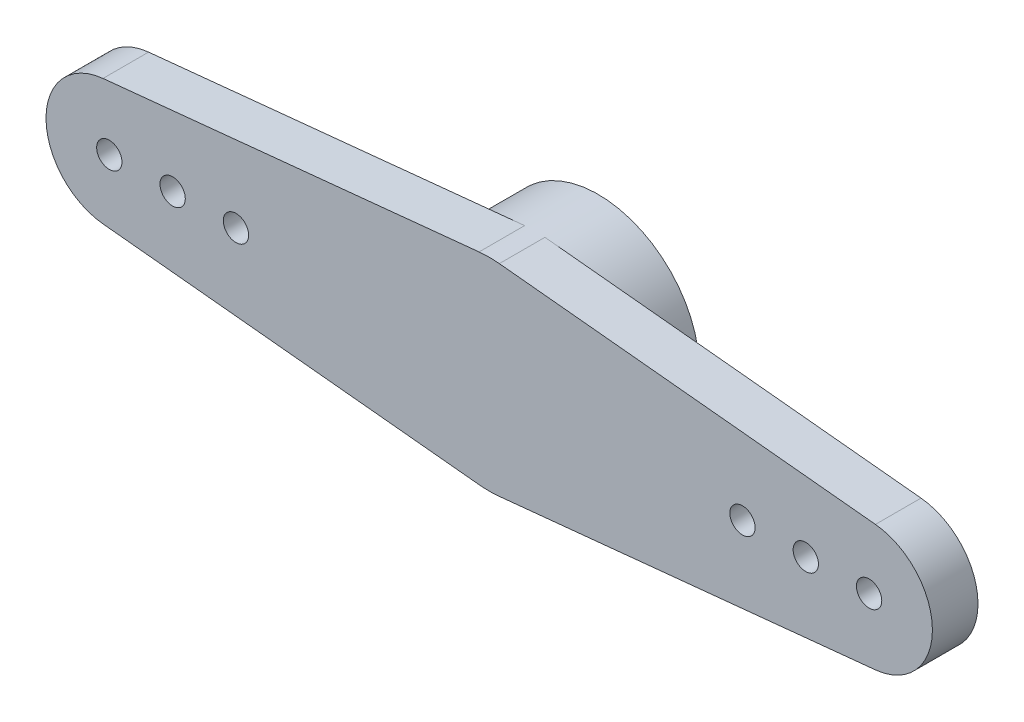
ISO-10303-21;
HEADER;
FILE_DESCRIPTION(('STEP AP214'),'2;1');
FILE_NAME('part.step','',(''),(''),'','','');
FILE_SCHEMA(('AUTOMOTIVE_DESIGN { 1 0 10303 214 1 1 1 1 }'));
ENDSEC;
DATA;
#1=APPLICATION_CONTEXT('core data for automotive mechanical design processes');
#2=APPLICATION_PROTOCOL_DEFINITION('international standard','automotive_design',2000,#1);
#3=PRODUCT_CONTEXT('',#1,'mechanical');
#4=PRODUCT('Part','Part','',(#3));
#5=PRODUCT_RELATED_PRODUCT_CATEGORY('part','',(#4));
#6=PRODUCT_DEFINITION_FORMATION('','',#4);
#7=PRODUCT_DEFINITION_CONTEXT('part definition',#1,'design');
#8=PRODUCT_DEFINITION('design','',#6,#7);
#9=PRODUCT_DEFINITION_SHAPE('','',#8);
#10=(LENGTH_UNIT() NAMED_UNIT(*) SI_UNIT(.MILLI.,.METRE.));
#11=(NAMED_UNIT(*) PLANE_ANGLE_UNIT() SI_UNIT($,.RADIAN.));
#12=(NAMED_UNIT(*) SI_UNIT($,.STERADIAN.) SOLID_ANGLE_UNIT());
#13=UNCERTAINTY_MEASURE_WITH_UNIT(LENGTH_MEASURE(1.E-05),#10,'distance_accuracy_value','');
#14=(GEOMETRIC_REPRESENTATION_CONTEXT(3) GLOBAL_UNCERTAINTY_ASSIGNED_CONTEXT((#13)) GLOBAL_UNIT_ASSIGNED_CONTEXT((#10,
#11,#12)) REPRESENTATION_CONTEXT('',''));
#15=CARTESIAN_POINT('',(0.,0.,0.));
#16=DIRECTION('',(0.,0.,1.));
#17=DIRECTION('',(1.,0.,0.));
#18=AXIS2_PLACEMENT_3D('',#15,#16,#17);
#19=CARTESIAN_POINT('',(0.,0.,0.));
#20=DIRECTION('',(0.,0.,1.));
#21=DIRECTION('',(1.,0.,0.));
#22=AXIS2_PLACEMENT_3D('',#19,#20,#21);
#23=PLANE('',#22);
#24=CARTESIAN_POINT('',(-12.5,0.,0.));
#25=DIRECTION('',(0.,0.,1.));
#26=DIRECTION('',(1.,0.,0.));
#27=AXIS2_PLACEMENT_3D('',#24,#25,#26);
#28=CIRCLE('',#27,0.500000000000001);
#29=CARTESIAN_POINT('',(-12.,0.,0.));
#30=VERTEX_POINT('',#29);
#31=EDGE_CURVE('E181',#30,#30,#28,.T.);
#32=ORIENTED_EDGE('',*,*,#31,.T.);
#33=EDGE_LOOP('',(#32));
#34=FACE_BOUND('',#33,.T.);
#35=CARTESIAN_POINT('',(-15.,0.,0.));
#36=DIRECTION('',(0.,0.,1.));
#37=DIRECTION('',(1.,0.,0.));
#38=AXIS2_PLACEMENT_3D('',#35,#36,#37);
#39=CIRCLE('',#38,0.500000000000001);
#40=CARTESIAN_POINT('',(-14.5,0.,0.));
#41=VERTEX_POINT('',#40);
#42=EDGE_CURVE('E175',#41,#41,#39,.T.);
#43=ORIENTED_EDGE('',*,*,#42,.T.);
#44=EDGE_LOOP('',(#43));
#45=FACE_BOUND('',#44,.T.);
#46=CARTESIAN_POINT('',(-10.,0.,0.));
#47=DIRECTION('',(0.,0.,1.));
#48=DIRECTION('',(1.,0.,0.));
#49=AXIS2_PLACEMENT_3D('',#46,#47,#48);
#50=CIRCLE('',#49,0.500000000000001);
#51=CARTESIAN_POINT('',(-9.5,0.,0.));
#52=VERTEX_POINT('',#51);
#53=EDGE_CURVE('E187',#52,#52,#50,.T.);
#54=ORIENTED_EDGE('',*,*,#53,.T.);
#55=EDGE_LOOP('',(#54));
#56=FACE_BOUND('',#55,.T.);
#57=DIRECTION('',(-0.99498743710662,-0.1,0.));
#58=VECTOR('',#57,1.);
#59=CARTESIAN_POINT('',(-15.25,2.48746859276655,0.));
#60=LINE('',#59,#58);
#61=CARTESIAN_POINT('',(-0.4,3.97994974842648,0.));
#62=VERTEX_POINT('',#61);
#63=CARTESIAN_POINT('',(-15.25,2.48746859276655,0.));
#64=VERTEX_POINT('',#63);
#65=EDGE_CURVE('E72',#62,#64,#60,.T.);
#66=ORIENTED_EDGE('',*,*,#65,.F.);
#67=CARTESIAN_POINT('',(0.,0.,0.));
#68=DIRECTION('',(0.,0.,1.));
#69=DIRECTION('',(1.,0.,0.));
#70=AXIS2_PLACEMENT_3D('',#67,#68,#69);
#71=CIRCLE('',#70,4.);
#72=CARTESIAN_POINT('',(-0.4,-3.97994974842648,0.));
#73=VERTEX_POINT('',#72);
#74=EDGE_CURVE('E211',#62,#73,#71,.T.);
#75=ORIENTED_EDGE('',*,*,#74,.T.);
#76=DIRECTION('',(0.99498743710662,-0.1,0.));
#77=VECTOR('',#76,1.);
#78=CARTESIAN_POINT('',(-15.25,-2.48746859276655,0.));
#79=LINE('',#78,#77);
#80=CARTESIAN_POINT('',(-15.25,-2.48746859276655,0.));
#81=VERTEX_POINT('',#80);
#82=EDGE_CURVE('E132',#81,#73,#79,.T.);
#83=ORIENTED_EDGE('',*,*,#82,.F.);
#84=CARTESIAN_POINT('',(-15.,0.,0.));
#85=DIRECTION('',(0.,0.,1.));
#86=DIRECTION('',(1.,0.,0.));
#87=AXIS2_PLACEMENT_3D('',#84,#85,#86);
#88=CIRCLE('',#87,2.5);
#89=EDGE_CURVE('E79',#64,#81,#88,.T.);
#90=ORIENTED_EDGE('',*,*,#89,.F.);
#91=EDGE_LOOP('',(#66,#75,#83,#90));
#92=FACE_BOUND('',#91,.T.);
#93=ADVANCED_FACE('F34',(#34,#45,#56,#92),#23,.F.);
#94=CARTESIAN_POINT('',(0.,0.,1.8));
#95=DIRECTION('',(0.,0.,1.));
#96=DIRECTION('',(1.,0.,0.));
#97=AXIS2_PLACEMENT_3D('',#94,#95,#96);
#98=PLANE('',#97);
#99=DIRECTION('',(-0.99498743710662,0.1,0.));
#100=VECTOR('',#99,1.);
#101=CARTESIAN_POINT('',(0.4,3.97994974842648,1.8));
#102=LINE('',#101,#100);
#103=CARTESIAN_POINT('',(15.25,2.48746859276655,1.8));
#104=VERTEX_POINT('',#103);
#105=CARTESIAN_POINT('',(0.4,3.97994974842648,1.8));
#106=VERTEX_POINT('',#105);
#107=EDGE_CURVE('E169',#104,#106,#102,.T.);
#108=ORIENTED_EDGE('',*,*,#107,.T.);
#109=CARTESIAN_POINT('',(0.,0.,1.8));
#110=DIRECTION('',(0.,0.,1.));
#111=DIRECTION('',(1.,0.,0.));
#112=AXIS2_PLACEMENT_3D('',#109,#110,#111);
#113=CIRCLE('',#112,4.);
#114=CARTESIAN_POINT('',(-0.4,3.97994974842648,1.8));
#115=VERTEX_POINT('',#114);
#116=EDGE_CURVE('E108',#106,#115,#113,.T.);
#117=ORIENTED_EDGE('',*,*,#116,.T.);
#118=DIRECTION('',(-0.99498743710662,-0.1,0.));
#119=VECTOR('',#118,1.);
#120=CARTESIAN_POINT('',(-15.25,2.48746859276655,1.8));
#121=LINE('',#120,#119);
#122=CARTESIAN_POINT('',(-15.25,2.48746859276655,1.8));
#123=VERTEX_POINT('',#122);
#124=EDGE_CURVE('E102',#115,#123,#121,.T.);
#125=ORIENTED_EDGE('',*,*,#124,.T.);
#126=CARTESIAN_POINT('',(-15.,0.,1.8));
#127=DIRECTION('',(0.,0.,1.));
#128=DIRECTION('',(1.,0.,0.));
#129=AXIS2_PLACEMENT_3D('',#126,#127,#128);
#130=CIRCLE('',#129,2.5);
#131=CARTESIAN_POINT('',(-15.25,-2.48746859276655,1.8));
#132=VERTEX_POINT('',#131);
#133=EDGE_CURVE('E106',#123,#132,#130,.T.);
#134=ORIENTED_EDGE('',*,*,#133,.T.);
#135=DIRECTION('',(0.99498743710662,-0.1,0.));
#136=VECTOR('',#135,1.);
#137=CARTESIAN_POINT('',(-15.25,-2.48746859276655,1.8));
#138=LINE('',#137,#136);
#139=CARTESIAN_POINT('',(-0.4,-3.97994974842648,1.8));
#140=VERTEX_POINT('',#139);
#141=EDGE_CURVE('E51',#132,#140,#138,.T.);
#142=ORIENTED_EDGE('',*,*,#141,.T.);
#143=CARTESIAN_POINT('',(0.,0.,1.8));
#144=DIRECTION('',(0.,0.,1.));
#145=DIRECTION('',(1.,0.,0.));
#146=AXIS2_PLACEMENT_3D('',#143,#144,#145);
#147=CIRCLE('',#146,4.);
#148=CARTESIAN_POINT('',(0.4,-3.97994974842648,1.8));
#149=VERTEX_POINT('',#148);
#150=EDGE_CURVE('E135',#140,#149,#147,.T.);
#151=ORIENTED_EDGE('',*,*,#150,.T.);
#152=DIRECTION('',(0.99498743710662,0.1,0.));
#153=VECTOR('',#152,1.);
#154=CARTESIAN_POINT('',(15.25,-2.48746859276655,1.8));
#155=LINE('',#154,#153);
#156=CARTESIAN_POINT('',(15.25,-2.48746859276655,1.8));
#157=VERTEX_POINT('',#156);
#158=EDGE_CURVE('E87',#149,#157,#155,.T.);
#159=ORIENTED_EDGE('',*,*,#158,.T.);
#160=CARTESIAN_POINT('',(15.,0.,1.8));
#161=DIRECTION('',(0.,0.,1.));
#162=DIRECTION('',(1.,0.,0.));
#163=AXIS2_PLACEMENT_3D('',#160,#161,#162);
#164=CIRCLE('',#163,2.5);
#165=EDGE_CURVE('E151',#157,#104,#164,.T.);
#166=ORIENTED_EDGE('',*,*,#165,.T.);
#167=EDGE_LOOP('',(#108,#117,#125,#134,#142,#151,#159,#166));
#168=FACE_BOUND('',#167,.T.);
#169=CARTESIAN_POINT('',(12.5,0.,1.8));
#170=DIRECTION('',(0.,0.,1.));
#171=DIRECTION('',(1.,0.,0.));
#172=AXIS2_PLACEMENT_3D('',#169,#170,#171);
#173=CIRCLE('',#172,0.500000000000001);
#174=CARTESIAN_POINT('',(13.,0.,1.8));
#175=VERTEX_POINT('',#174);
#176=EDGE_CURVE('E196',#175,#175,#173,.T.);
#177=ORIENTED_EDGE('',*,*,#176,.F.);
#178=EDGE_LOOP('',(#177));
#179=FACE_BOUND('',#178,.T.);
#180=CARTESIAN_POINT('',(10.,0.,1.8));
#181=DIRECTION('',(0.,0.,1.));
#182=DIRECTION('',(1.,0.,0.));
#183=AXIS2_PLACEMENT_3D('',#180,#181,#182);
#184=CIRCLE('',#183,0.500000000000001);
#185=CARTESIAN_POINT('',(10.5,0.,1.8));
#186=VERTEX_POINT('',#185);
#187=EDGE_CURVE('E190',#186,#186,#184,.T.);
#188=ORIENTED_EDGE('',*,*,#187,.F.);
#189=EDGE_LOOP('',(#188));
#190=FACE_BOUND('',#189,.T.);
#191=CARTESIAN_POINT('',(15.,0.,1.8));
#192=DIRECTION('',(0.,0.,1.));
#193=DIRECTION('',(1.,0.,0.));
#194=AXIS2_PLACEMENT_3D('',#191,#192,#193);
#195=CIRCLE('',#194,0.500000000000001);
#196=CARTESIAN_POINT('',(15.5,0.,1.8));
#197=VERTEX_POINT('',#196);
#198=EDGE_CURVE('E202',#197,#197,#195,.T.);
#199=ORIENTED_EDGE('',*,*,#198,.F.);
#200=EDGE_LOOP('',(#199));
#201=FACE_BOUND('',#200,.T.);
#202=CARTESIAN_POINT('',(-12.5,0.,1.8));
#203=DIRECTION('',(0.,0.,1.));
#204=DIRECTION('',(1.,0.,0.));
#205=AXIS2_PLACEMENT_3D('',#202,#203,#204);
#206=CIRCLE('',#205,0.500000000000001);
#207=CARTESIAN_POINT('',(-12.,0.,1.8));
#208=VERTEX_POINT('',#207);
#209=EDGE_CURVE('E178',#208,#208,#206,.T.);
#210=ORIENTED_EDGE('',*,*,#209,.F.);
#211=EDGE_LOOP('',(#210));
#212=FACE_BOUND('',#211,.T.);
#213=CARTESIAN_POINT('',(-15.,0.,1.8));
#214=DIRECTION('',(0.,0.,1.));
#215=DIRECTION('',(1.,0.,0.));
#216=AXIS2_PLACEMENT_3D('',#213,#214,#215);
#217=CIRCLE('',#216,0.500000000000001);
#218=CARTESIAN_POINT('',(-14.5,0.,1.8));
#219=VERTEX_POINT('',#218);
#220=EDGE_CURVE('E125',#219,#219,#217,.T.);
#221=ORIENTED_EDGE('',*,*,#220,.F.);
#222=EDGE_LOOP('',(#221));
#223=FACE_BOUND('',#222,.T.);
#224=CARTESIAN_POINT('',(-10.,0.,1.8));
#225=DIRECTION('',(0.,0.,1.));
#226=DIRECTION('',(1.,0.,0.));
#227=AXIS2_PLACEMENT_3D('',#224,#225,#226);
#228=CIRCLE('',#227,0.500000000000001);
#229=CARTESIAN_POINT('',(-9.5,0.,1.8));
#230=VERTEX_POINT('',#229);
#231=EDGE_CURVE('E184',#230,#230,#228,.T.);
#232=ORIENTED_EDGE('',*,*,#231,.F.);
#233=EDGE_LOOP('',(#232));
#234=FACE_BOUND('',#233,.T.);
#235=ADVANCED_FACE('F103',(#168,#179,#190,#201,#212,#223,#234),#98,.T.);
#236=CARTESIAN_POINT('',(12.5,0.,0.));
#237=DIRECTION('',(0.,0.,1.));
#238=DIRECTION('',(1.,0.,0.));
#239=AXIS2_PLACEMENT_3D('',#236,#237,#238);
#240=CIRCLE('',#239,0.500000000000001);
#241=CARTESIAN_POINT('',(13.,0.,0.));
#242=VERTEX_POINT('',#241);
#243=EDGE_CURVE('E199',#242,#242,#240,.T.);
#244=ORIENTED_EDGE('',*,*,#243,.T.);
#245=EDGE_LOOP('',(#244));
#246=FACE_BOUND('',#245,.T.);
#247=DIRECTION('',(0.99498743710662,0.1,0.));
#248=VECTOR('',#247,1.);
#249=CARTESIAN_POINT('',(15.25,-2.48746859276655,0.));
#250=LINE('',#249,#248);
#251=CARTESIAN_POINT('',(0.4,-3.97994974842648,0.));
#252=VERTEX_POINT('',#251);
#253=CARTESIAN_POINT('',(15.25,-2.48746859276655,0.));
#254=VERTEX_POINT('',#253);
#255=EDGE_CURVE('E122',#252,#254,#250,.T.);
#256=ORIENTED_EDGE('',*,*,#255,.F.);
#257=CARTESIAN_POINT('',(0.4,3.97994974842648,0.));
#258=VERTEX_POINT('',#257);
#259=EDGE_CURVE('E159',#252,#258,#71,.T.);
#260=ORIENTED_EDGE('',*,*,#259,.T.);
#261=DIRECTION('',(-0.99498743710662,0.1,0.));
#262=VECTOR('',#261,1.);
#263=CARTESIAN_POINT('',(0.4,3.97994974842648,0.));
#264=LINE('',#263,#262);
#265=CARTESIAN_POINT('',(15.25,2.48746859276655,0.));
#266=VERTEX_POINT('',#265);
#267=EDGE_CURVE('E127',#266,#258,#264,.T.);
#268=ORIENTED_EDGE('',*,*,#267,.F.);
#269=CARTESIAN_POINT('',(15.,0.,0.));
#270=DIRECTION('',(0.,0.,1.));
#271=DIRECTION('',(1.,0.,0.));
#272=AXIS2_PLACEMENT_3D('',#269,#270,#271);
#273=CIRCLE('',#272,2.5);
#274=EDGE_CURVE('E124',#254,#266,#273,.T.);
#275=ORIENTED_EDGE('',*,*,#274,.F.);
#276=EDGE_LOOP('',(#256,#260,#268,#275));
#277=FACE_BOUND('',#276,.T.);
#278=CARTESIAN_POINT('',(10.,0.,0.));
#279=DIRECTION('',(0.,0.,1.));
#280=DIRECTION('',(1.,0.,0.));
#281=AXIS2_PLACEMENT_3D('',#278,#279,#280);
#282=CIRCLE('',#281,0.500000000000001);
#283=CARTESIAN_POINT('',(10.5,0.,0.));
#284=VERTEX_POINT('',#283);
#285=EDGE_CURVE('E193',#284,#284,#282,.T.);
#286=ORIENTED_EDGE('',*,*,#285,.T.);
#287=EDGE_LOOP('',(#286));
#288=FACE_BOUND('',#287,.T.);
#289=CARTESIAN_POINT('',(15.,0.,0.));
#290=DIRECTION('',(0.,0.,1.));
#291=DIRECTION('',(1.,0.,0.));
#292=AXIS2_PLACEMENT_3D('',#289,#290,#291);
#293=CIRCLE('',#292,0.500000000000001);
#294=CARTESIAN_POINT('',(15.5,0.,0.));
#295=VERTEX_POINT('',#294);
#296=EDGE_CURVE('E205',#295,#295,#293,.T.);
#297=ORIENTED_EDGE('',*,*,#296,.T.);
#298=EDGE_LOOP('',(#297));
#299=FACE_BOUND('',#298,.T.);
#300=ADVANCED_FACE('F155',(#246,#277,#288,#299),#23,.F.);
#301=CARTESIAN_POINT('',(15.25,-2.48746859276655,1.8));
#302=DIRECTION('',(-0.1,0.99498743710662,0.));
#303=DIRECTION('',(-0.99498743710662,-0.1,0.));
#304=AXIS2_PLACEMENT_3D('',#301,#302,#303);
#305=PLANE('',#304);
#306=ORIENTED_EDGE('',*,*,#255,.T.);
#307=DIRECTION('',(0.,0.,-1.));
#308=VECTOR('',#307,1.);
#309=CARTESIAN_POINT('',(15.25,-2.48746859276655,1.8));
#310=LINE('',#309,#308);
#311=EDGE_CURVE('E43',#157,#254,#310,.T.);
#312=ORIENTED_EDGE('',*,*,#311,.F.);
#313=ORIENTED_EDGE('',*,*,#158,.F.);
#314=DIRECTION('',(0.,0.,-1.));
#315=VECTOR('',#314,1.);
#316=CARTESIAN_POINT('',(0.4,-3.97994974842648,1.8));
#317=LINE('',#316,#315);
#318=EDGE_CURVE('E11',#149,#252,#317,.T.);
#319=ORIENTED_EDGE('',*,*,#318,.T.);
#320=EDGE_LOOP('',(#306,#312,#313,#319));
#321=FACE_BOUND('',#320,.T.);
#322=ADVANCED_FACE('F36',(#321),#305,.F.);
#323=CARTESIAN_POINT('',(15.,0.,1.8));
#324=DIRECTION('',(0.,0.,-1.));
#325=DIRECTION('',(-1.,0.,0.));
#326=AXIS2_PLACEMENT_3D('',#323,#324,#325);
#327=CYLINDRICAL_SURFACE('',#326,2.5);
#328=ORIENTED_EDGE('',*,*,#274,.T.);
#329=DIRECTION('',(0.,0.,-1.));
#330=VECTOR('',#329,1.);
#331=CARTESIAN_POINT('',(15.25,2.48746859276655,1.8));
#332=LINE('',#331,#330);
#333=EDGE_CURVE('E143',#104,#266,#332,.T.);
#334=ORIENTED_EDGE('',*,*,#333,.F.);
#335=ORIENTED_EDGE('',*,*,#165,.F.);
#336=ORIENTED_EDGE('',*,*,#311,.T.);
#337=EDGE_LOOP('',(#328,#334,#335,#336));
#338=FACE_BOUND('',#337,.T.);
#339=ADVANCED_FACE('F149',(#338),#327,.T.);
#340=CARTESIAN_POINT('',(0.4,3.97994974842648,1.8));
#341=DIRECTION('',(-0.1,-0.99498743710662,0.));
#342=DIRECTION('',(0.99498743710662,-0.1,0.));
#343=AXIS2_PLACEMENT_3D('',#340,#341,#342);
#344=PLANE('',#343);
#345=ORIENTED_EDGE('',*,*,#267,.T.);
#346=DIRECTION('',(0.,0.,-1.));
#347=VECTOR('',#346,1.);
#348=CARTESIAN_POINT('',(0.4,3.97994974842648,1.8));
#349=LINE('',#348,#347);
#350=EDGE_CURVE('E140',#106,#258,#349,.T.);
#351=ORIENTED_EDGE('',*,*,#350,.F.);
#352=ORIENTED_EDGE('',*,*,#107,.F.);
#353=ORIENTED_EDGE('',*,*,#333,.T.);
#354=EDGE_LOOP('',(#345,#351,#352,#353));
#355=FACE_BOUND('',#354,.T.);
#356=ADVANCED_FACE('F162',(#355),#344,.F.);
#357=CARTESIAN_POINT('',(0.,0.,1.8));
#358=DIRECTION('',(0.,0.,-1.));
#359=DIRECTION('',(-1.,0.,0.));
#360=AXIS2_PLACEMENT_3D('',#357,#358,#359);
#361=CYLINDRICAL_SURFACE('',#360,4.);
#362=ORIENTED_EDGE('',*,*,#350,.T.);
#363=ORIENTED_EDGE('',*,*,#259,.F.);
#364=ORIENTED_EDGE('',*,*,#318,.F.);
#365=ORIENTED_EDGE('',*,*,#150,.F.);
#366=DIRECTION('',(0.,0.,-1.));
#367=VECTOR('',#366,1.);
#368=CARTESIAN_POINT('',(-0.4,-3.97994974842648,1.8));
#369=LINE('',#368,#367);
#370=EDGE_CURVE('E118',#140,#73,#369,.T.);
#371=ORIENTED_EDGE('',*,*,#370,.T.);
#372=ORIENTED_EDGE('',*,*,#74,.F.);
#373=DIRECTION('',(0.,0.,-1.));
#374=VECTOR('',#373,1.);
#375=CARTESIAN_POINT('',(-0.4,3.97994974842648,1.8));
#376=LINE('',#375,#374);
#377=EDGE_CURVE('E113',#115,#62,#376,.T.);
#378=ORIENTED_EDGE('',*,*,#377,.F.);
#379=ORIENTED_EDGE('',*,*,#116,.F.);
#380=EDGE_LOOP('',(#362,#363,#364,#365,#371,#372,#378,#379));
#381=FACE_BOUND('',#380,.T.);
#382=CARTESIAN_POINT('',(0.,0.,-2.5));
#383=DIRECTION('',(0.,0.,-1.));
#384=DIRECTION('',(-1.,0.,0.));
#385=AXIS2_PLACEMENT_3D('',#382,#383,#384);
#386=CIRCLE('',#385,4.);
#387=CARTESIAN_POINT('',(-4.,0.,-2.5));
#388=VERTEX_POINT('',#387);
#389=EDGE_CURVE('E212',#388,#388,#386,.T.);
#390=ORIENTED_EDGE('',*,*,#389,.F.);
#391=EDGE_LOOP('',(#390));
#392=FACE_BOUND('',#391,.T.);
#393=ADVANCED_FACE('F165',(#381,#392),#361,.T.);
#394=CARTESIAN_POINT('',(-15.25,2.48746859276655,1.8));
#395=DIRECTION('',(0.1,-0.99498743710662,0.));
#396=DIRECTION('',(0.99498743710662,0.1,0.));
#397=AXIS2_PLACEMENT_3D('',#394,#395,#396);
#398=PLANE('',#397);
#399=ORIENTED_EDGE('',*,*,#65,.T.);
#400=DIRECTION('',(0.,0.,-1.));
#401=VECTOR('',#400,1.);
#402=CARTESIAN_POINT('',(-15.25,2.48746859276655,1.8));
#403=LINE('',#402,#401);
#404=EDGE_CURVE('E111',#123,#64,#403,.T.);
#405=ORIENTED_EDGE('',*,*,#404,.F.);
#406=ORIENTED_EDGE('',*,*,#124,.F.);
#407=ORIENTED_EDGE('',*,*,#377,.T.);
#408=EDGE_LOOP('',(#399,#405,#406,#407));
#409=FACE_BOUND('',#408,.T.);
#410=ADVANCED_FACE('F112',(#409),#398,.F.);
#411=CARTESIAN_POINT('',(-15.,0.,1.8));
#412=DIRECTION('',(0.,0.,-1.));
#413=DIRECTION('',(-1.,0.,0.));
#414=AXIS2_PLACEMENT_3D('',#411,#412,#413);
#415=CYLINDRICAL_SURFACE('',#414,2.5);
#416=ORIENTED_EDGE('',*,*,#89,.T.);
#417=DIRECTION('',(0.,0.,-1.));
#418=VECTOR('',#417,1.);
#419=CARTESIAN_POINT('',(-15.25,-2.48746859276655,1.8));
#420=LINE('',#419,#418);
#421=EDGE_CURVE('E114',#132,#81,#420,.T.);
#422=ORIENTED_EDGE('',*,*,#421,.F.);
#423=ORIENTED_EDGE('',*,*,#133,.F.);
#424=ORIENTED_EDGE('',*,*,#404,.T.);
#425=EDGE_LOOP('',(#416,#422,#423,#424));
#426=FACE_BOUND('',#425,.T.);
#427=ADVANCED_FACE('F116',(#426),#415,.T.);
#428=CARTESIAN_POINT('',(-15.25,-2.48746859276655,1.8));
#429=DIRECTION('',(0.1,0.99498743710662,0.));
#430=DIRECTION('',(-0.99498743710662,0.1,0.));
#431=AXIS2_PLACEMENT_3D('',#428,#429,#430);
#432=PLANE('',#431);
#433=ORIENTED_EDGE('',*,*,#82,.T.);
#434=ORIENTED_EDGE('',*,*,#370,.F.);
#435=ORIENTED_EDGE('',*,*,#141,.F.);
#436=ORIENTED_EDGE('',*,*,#421,.T.);
#437=EDGE_LOOP('',(#433,#434,#435,#436));
#438=FACE_BOUND('',#437,.T.);
#439=ADVANCED_FACE('F284',(#438),#432,.F.);
#440=CARTESIAN_POINT('',(-15.,0.,1.8));
#441=DIRECTION('',(0.,0.,-1.));
#442=DIRECTION('',(-1.,0.,0.));
#443=AXIS2_PLACEMENT_3D('',#440,#441,#442);
#444=CYLINDRICAL_SURFACE('',#443,0.500000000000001);
#445=ORIENTED_EDGE('',*,*,#220,.T.);
#446=EDGE_LOOP('',(#445));
#447=FACE_BOUND('',#446,.T.);
#448=ORIENTED_EDGE('',*,*,#42,.F.);
#449=EDGE_LOOP('',(#448));
#450=FACE_BOUND('',#449,.T.);
#451=ADVANCED_FACE('F281',(#447,#450),#444,.F.);
#452=CARTESIAN_POINT('',(-12.5,0.,1.8));
#453=DIRECTION('',(0.,0.,-1.));
#454=DIRECTION('',(-1.,0.,0.));
#455=AXIS2_PLACEMENT_3D('',#452,#453,#454);
#456=CYLINDRICAL_SURFACE('',#455,0.500000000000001);
#457=ORIENTED_EDGE('',*,*,#209,.T.);
#458=EDGE_LOOP('',(#457));
#459=FACE_BOUND('',#458,.T.);
#460=ORIENTED_EDGE('',*,*,#31,.F.);
#461=EDGE_LOOP('',(#460));
#462=FACE_BOUND('',#461,.T.);
#463=ADVANCED_FACE('F277',(#459,#462),#456,.F.);
#464=CARTESIAN_POINT('',(-10.,0.,1.8));
#465=DIRECTION('',(0.,0.,-1.));
#466=DIRECTION('',(-1.,0.,0.));
#467=AXIS2_PLACEMENT_3D('',#464,#465,#466);
#468=CYLINDRICAL_SURFACE('',#467,0.500000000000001);
#469=ORIENTED_EDGE('',*,*,#231,.T.);
#470=EDGE_LOOP('',(#469));
#471=FACE_BOUND('',#470,.T.);
#472=ORIENTED_EDGE('',*,*,#53,.F.);
#473=EDGE_LOOP('',(#472));
#474=FACE_BOUND('',#473,.T.);
#475=ADVANCED_FACE('F271',(#471,#474),#468,.F.);
#476=CARTESIAN_POINT('',(10.,0.,1.8));
#477=DIRECTION('',(0.,0.,-1.));
#478=DIRECTION('',(-1.,0.,0.));
#479=AXIS2_PLACEMENT_3D('',#476,#477,#478);
#480=CYLINDRICAL_SURFACE('',#479,0.500000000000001);
#481=ORIENTED_EDGE('',*,*,#187,.T.);
#482=EDGE_LOOP('',(#481));
#483=FACE_BOUND('',#482,.T.);
#484=ORIENTED_EDGE('',*,*,#285,.F.);
#485=EDGE_LOOP('',(#484));
#486=FACE_BOUND('',#485,.T.);
#487=ADVANCED_FACE('F262',(#483,#486),#480,.F.);
#488=CARTESIAN_POINT('',(12.5,0.,1.8));
#489=DIRECTION('',(0.,0.,-1.));
#490=DIRECTION('',(-1.,0.,0.));
#491=AXIS2_PLACEMENT_3D('',#488,#489,#490);
#492=CYLINDRICAL_SURFACE('',#491,0.500000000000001);
#493=ORIENTED_EDGE('',*,*,#176,.T.);
#494=EDGE_LOOP('',(#493));
#495=FACE_BOUND('',#494,.T.);
#496=ORIENTED_EDGE('',*,*,#243,.F.);
#497=EDGE_LOOP('',(#496));
#498=FACE_BOUND('',#497,.T.);
#499=ADVANCED_FACE('F260',(#495,#498),#492,.F.);
#500=CARTESIAN_POINT('',(15.,0.,1.8));
#501=DIRECTION('',(0.,0.,-1.));
#502=DIRECTION('',(-1.,0.,0.));
#503=AXIS2_PLACEMENT_3D('',#500,#501,#502);
#504=CYLINDRICAL_SURFACE('',#503,0.500000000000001);
#505=ORIENTED_EDGE('',*,*,#198,.T.);
#506=EDGE_LOOP('',(#505));
#507=FACE_BOUND('',#506,.T.);
#508=ORIENTED_EDGE('',*,*,#296,.F.);
#509=EDGE_LOOP('',(#508));
#510=FACE_BOUND('',#509,.T.);
#511=ADVANCED_FACE('F233',(#507,#510),#504,.F.);
#512=CARTESIAN_POINT('',(0.,0.,-2.5));
#513=DIRECTION('',(0.,0.,-1.));
#514=DIRECTION('',(-1.,0.,0.));
#515=AXIS2_PLACEMENT_3D('',#512,#513,#514);
#516=PLANE('',#515);
#517=CARTESIAN_POINT('',(0.,0.,-2.5));
#518=DIRECTION('',(0.,0.,-1.));
#519=DIRECTION('',(-1.,0.,0.));
#520=AXIS2_PLACEMENT_3D('',#517,#518,#519);
#521=CIRCLE('',#520,2.5);
#522=CARTESIAN_POINT('',(-2.5,0.,-2.5));
#523=VERTEX_POINT('',#522);
#524=EDGE_CURVE('E216',#523,#523,#521,.T.);
#525=ORIENTED_EDGE('',*,*,#524,.F.);
#526=EDGE_LOOP('',(#525));
#527=FACE_BOUND('',#526,.T.);
#528=ORIENTED_EDGE('',*,*,#389,.T.);
#529=EDGE_LOOP('',(#528));
#530=FACE_BOUND('',#529,.T.);
#531=ADVANCED_FACE('F227',(#527,#530),#516,.T.);
#532=CARTESIAN_POINT('',(0.,0.,0.2));
#533=DIRECTION('',(0.,0.,-1.));
#534=DIRECTION('',(-1.,0.,0.));
#535=AXIS2_PLACEMENT_3D('',#532,#533,#534);
#536=CYLINDRICAL_SURFACE('',#535,2.5);
#537=CARTESIAN_POINT('',(0.,0.,0.2));
#538=DIRECTION('',(0.,0.,-1.));
#539=DIRECTION('',(-1.,0.,0.));
#540=AXIS2_PLACEMENT_3D('',#537,#538,#539);
#541=CIRCLE('',#540,2.5);
#542=CARTESIAN_POINT('',(-2.5,0.,0.2));
#543=VERTEX_POINT('',#542);
#544=EDGE_CURVE('E215',#543,#543,#541,.T.);
#545=CARTESIAN_POINT('',(-2.5,0.,0.2));
#546=CARTESIAN_POINT('',(-2.5,0.,0.171875));
#547=CARTESIAN_POINT('',(-2.5,0.,0.14375));
#548=CARTESIAN_POINT('',(-2.5,0.,0.0875000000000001));
#549=CARTESIAN_POINT('',(-2.5,0.,0.0593750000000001));
#550=CARTESIAN_POINT('',(-2.5,0.,0.00312500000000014));
#551=CARTESIAN_POINT('',(-2.5,0.,-0.0249999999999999));
#552=CARTESIAN_POINT('',(-2.5,0.,-0.0812499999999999));
#553=CARTESIAN_POINT('',(-2.5,0.,-0.109375));
#554=CARTESIAN_POINT('',(-2.5,0.,-0.165625));
#555=CARTESIAN_POINT('',(-2.5,0.,-0.19375));
#556=CARTESIAN_POINT('',(-2.5,0.,-0.25));
#557=CARTESIAN_POINT('',(-2.5,0.,-0.278125));
#558=CARTESIAN_POINT('',(-2.5,0.,-0.334375));
#559=CARTESIAN_POINT('',(-2.5,0.,-0.3625));
#560=CARTESIAN_POINT('',(-2.5,0.,-0.41875));
#561=CARTESIAN_POINT('',(-2.5,0.,-0.446875));
#562=CARTESIAN_POINT('',(-2.5,0.,-0.503125));
#563=CARTESIAN_POINT('',(-2.5,0.,-0.53125));
#564=CARTESIAN_POINT('',(-2.5,0.,-0.5875));
#565=CARTESIAN_POINT('',(-2.5,0.,-0.615625));
#566=CARTESIAN_POINT('',(-2.5,0.,-0.671875));
#567=CARTESIAN_POINT('',(-2.5,0.,-0.7));
#568=CARTESIAN_POINT('',(-2.5,0.,-0.75625));
#569=CARTESIAN_POINT('',(-2.5,0.,-0.784375));
#570=CARTESIAN_POINT('',(-2.5,0.,-0.840625));
#571=CARTESIAN_POINT('',(-2.5,0.,-0.86875));
#572=CARTESIAN_POINT('',(-2.5,0.,-0.925));
#573=CARTESIAN_POINT('',(-2.5,0.,-0.953125));
#574=CARTESIAN_POINT('',(-2.5,0.,-1.009375));
#575=CARTESIAN_POINT('',(-2.5,0.,-1.0375));
#576=CARTESIAN_POINT('',(-2.5,0.,-1.09375));
#577=CARTESIAN_POINT('',(-2.5,0.,-1.121875));
#578=CARTESIAN_POINT('',(-2.5,0.,-1.178125));
#579=CARTESIAN_POINT('',(-2.5,0.,-1.20625));
#580=CARTESIAN_POINT('',(-2.5,0.,-1.2625));
#581=CARTESIAN_POINT('',(-2.5,0.,-1.290625));
#582=CARTESIAN_POINT('',(-2.5,0.,-1.346875));
#583=CARTESIAN_POINT('',(-2.5,0.,-1.375));
#584=CARTESIAN_POINT('',(-2.5,0.,-1.43125));
#585=CARTESIAN_POINT('',(-2.5,0.,-1.459375));
#586=CARTESIAN_POINT('',(-2.5,0.,-1.515625));
#587=CARTESIAN_POINT('',(-2.5,0.,-1.54375));
#588=CARTESIAN_POINT('',(-2.5,0.,-1.6));
#589=CARTESIAN_POINT('',(-2.5,0.,-1.628125));
#590=CARTESIAN_POINT('',(-2.5,0.,-1.684375));
#591=CARTESIAN_POINT('',(-2.5,0.,-1.7125));
#592=CARTESIAN_POINT('',(-2.5,0.,-1.76875));
#593=CARTESIAN_POINT('',(-2.5,0.,-1.796875));
#594=CARTESIAN_POINT('',(-2.5,0.,-1.853125));
#595=CARTESIAN_POINT('',(-2.5,0.,-1.88125));
#596=CARTESIAN_POINT('',(-2.5,0.,-1.9375));
#597=CARTESIAN_POINT('',(-2.5,0.,-1.965625));
#598=CARTESIAN_POINT('',(-2.5,0.,-2.021875));
#599=CARTESIAN_POINT('',(-2.5,0.,-2.05));
#600=CARTESIAN_POINT('',(-2.5,0.,-2.10625));
#601=CARTESIAN_POINT('',(-2.5,0.,-2.134375));
#602=CARTESIAN_POINT('',(-2.5,0.,-2.190625));
#603=CARTESIAN_POINT('',(-2.5,0.,-2.21875));
#604=CARTESIAN_POINT('',(-2.5,0.,-2.275));
#605=CARTESIAN_POINT('',(-2.5,0.,-2.303125));
#606=CARTESIAN_POINT('',(-2.5,0.,-2.359375));
#607=CARTESIAN_POINT('',(-2.5,0.,-2.3875));
#608=CARTESIAN_POINT('',(-2.5,0.,-2.44375));
#609=CARTESIAN_POINT('',(-2.5,0.,-2.471875));
#610=CARTESIAN_POINT('',(-2.5,0.,-2.5));
#611=B_SPLINE_CURVE_WITH_KNOTS('',3,(#545,#546,#547,#548,#549,#550,#551,#552,#553,#554,#555,
#556,#557,#558,#559,#560,#561,#562,#563,#564,#565,#566,#567,#568,#569,#570,#571,#572,#573,#574,
#575,#576,#577,#578,#579,#580,#581,#582,#583,#584,#585,#586,#587,#588,#589,#590,#591,#592,#593,
#594,#595,#596,#597,#598,#599,#600,#601,#602,#603,#604,#605,#606,#607,#608,#609,#610),
.UNSPECIFIED.,.F.,.F.,(4,2,2,2,2,2,2,2,2,2,2,2,2,2,2,2,2,2,2,2,2,2,2,2,2,2,2,2,2,2,2,2,4),(0.,
0.084375,0.16875,0.253125,0.3375,0.421875,0.50625,0.590625,0.675,0.759375,0.84375,0.928125,
1.0125,1.096875,1.18125,1.265625,1.35,1.434375,1.51875,1.603125,1.6875,1.771875,1.85625,
1.940625,2.025,2.109375,2.19375,2.278125,2.3625,2.446875,2.53125,2.615625,2.7),.UNSPECIFIED.);
#612=EDGE_CURVE('BSEAM224',#543,#523,#611,.T.);
#613=ORIENTED_EDGE('',*,*,#544,.F.);
#614=ORIENTED_EDGE('',*,*,#524,.T.);
#615=ORIENTED_EDGE('',*,*,#612,.T.);
#616=ORIENTED_EDGE('',*,*,#612,.F.);
#617=EDGE_LOOP('',(#613,#615,#614,#616));
#618=FACE_BOUND('',#617,.T.);
#619=ADVANCED_FACE('F224',(#618),#536,.F.);
#620=CARTESIAN_POINT('',(0.,0.,0.2));
#621=DIRECTION('',(0.,0.,-1.));
#622=DIRECTION('',(-1.,0.,0.));
#623=AXIS2_PLACEMENT_3D('',#620,#621,#622);
#624=PLANE('',#623);
#625=ORIENTED_EDGE('',*,*,#544,.T.);
#626=EDGE_LOOP('',(#625));
#627=FACE_BOUND('',#626,.T.);
#628=ADVANCED_FACE('F222',(#627),#624,.T.);
#629=CLOSED_SHELL('',(#93,#235,#300,#322,#339,#356,#393,#410,#427,#439,#451,#463,#475,#487,#499,
#511,#531,#619,#628));
#630=MANIFOLD_SOLID_BREP('B2',#629);
#631=ADVANCED_BREP_SHAPE_REPRESENTATION('',(#18,#630),#14);
#632=SHAPE_DEFINITION_REPRESENTATION(#9,#631);
ENDSEC;
END-ISO-10303-21;
